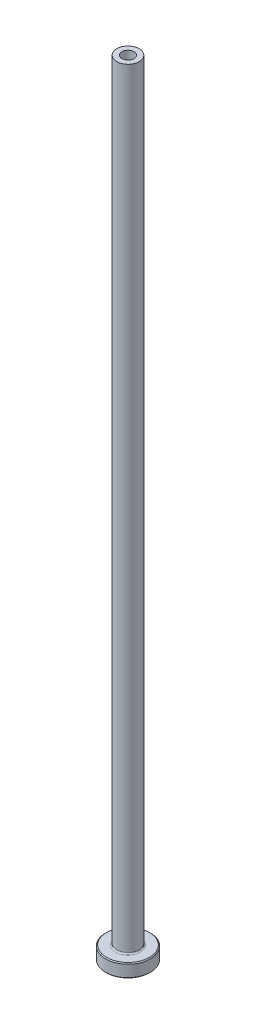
from build123d import *

# Parameters (mm, degrees)
FILLET1_R     = 0.3
CHAMFER1_SIZE = 0.2
CHAMFER3_SIZE = 0.5


with BuildPart() as part:
    # Sketch1 → Revolve1 (revolve)
    with BuildSketch(Plane.XY, mode=Mode.PRIVATE) as revolve1_sk:
        Polygon((-1.35, 175), (-2.5, 175), (-2.5, 3), (-5, 3), (-5, 0), (-1.6, 0), (-1.6, 118), (-1.35, 130), align=None)
    revolve(revolve1_sk.sketch.rotate(Axis((0, 92.187680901, 0), (0, -1, 0)), 270), axis=Axis((0, 92.187680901, 0), (0, -1, 0)))

    # Fillet1
    fillet1_edges = [part.edges().sort_by_distance(p)[0] for p in [
        (0, 3, -2.5),
    ]]
    fillet(fillet1_edges, radius=FILLET1_R)

    # Chamfer1
    chamfer1_edges = [part.edges().sort_by_distance(p)[0] for p in [
        (0, 0, -5),
        (0, 3, -5),
    ]]
    chamfer(chamfer1_edges, length=CHAMFER1_SIZE)

    # Chamfer3
    chamfer3_edges = [part.edges().sort_by_distance(p)[0] for p in [
        (0, 0, -1.6),
    ]]
    chamfer(chamfer3_edges, length=CHAMFER3_SIZE)


solid = part.part
